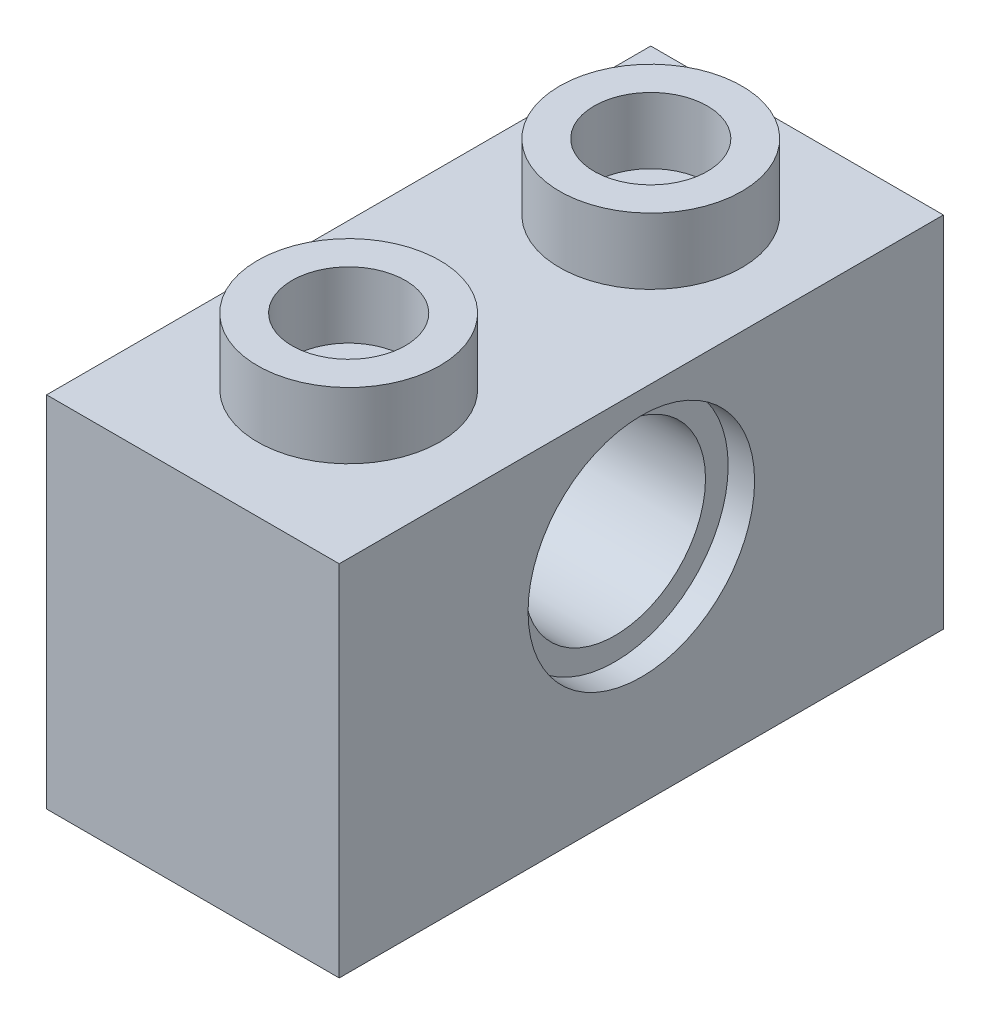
from build123d import *

# Parameters (mm, degrees)
SKETCH1_W           = 7.75
SKETCH1_H           = 9.5
BOSS_EXTRUDE1_DEPTH = 16
SKETCH2_R           = 2.415
SKETCH2_R_2         = 1.5
BOSS_EXTRUDE2_DEPTH = 1.75
SKETCH3_W           = 4.85
SKETCH3_H           = 13.1
CUT_EXTRUDE1_DEPTH  = 1.75
SKETCH4_R           = 1.5
BOSS_EXTRUDE3_DEPTH = 1.75
SKETCH5_R           = 3
CUT_EXTRUDE2_DEPTH  = 0.7
CUT_EXTRUDE3_START  = -0.7
SKETCH6_R           = 3
CUT_EXTRUDE3_DEPTH  = 0.7
SKETCH7_R           = 2.4
CUT_EXTRUDE5_DEPTH  = 19.653484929


with BuildPart() as part:
    # Sketch1 → Boss-Extrude1 (new body)
    with BuildSketch(Plane.XY):
        Rectangle(SKETCH1_W, SKETCH1_H)
    extrude(amount=BOSS_EXTRUDE1_DEPTH)

    # Sketch2 → Boss-Extrude2 (add)
    # profile 1 of 2: a face of its own
    with BuildSketch(Plane(origin=(0, 4.75, 0), x_dir=(1, 0, 0), z_dir=(0, 1, 0))):
        with Locations((0, -3.875)):
            Circle(SKETCH2_R)
        with Locations(Location((0, -3.875, 0), (0, 0, 180))):
            Circle(SKETCH2_R_2, mode=Mode.SUBTRACT)
    # profile 2 of 2: a face of its own
    with BuildSketch(Plane(origin=(0, 4.75, 0), x_dir=(1, 0, 0), z_dir=(0, 1, 0))):
        with Locations((0, -11.875)):
            Circle(SKETCH2_R)
        with Locations(Location((0, -11.875, 0), (0, 0, 180))):
            Circle(SKETCH2_R_2, mode=Mode.SUBTRACT)
    extrude(amount=BOSS_EXTRUDE2_DEPTH)

    # Sketch3 → Cut-Extrude1 (cut)
    with BuildSketch(Plane.XZ.offset(4.75)):
        with Locations((0, 8)):
            Rectangle(SKETCH3_W, SKETCH3_H)
    extrude(amount=-CUT_EXTRUDE1_DEPTH, mode=Mode.SUBTRACT)

    # Sketch4 → Boss-Extrude3 (add)
    with BuildSketch(Plane.XZ.offset(3)):
        with Locations(Location((0, 8, 0), (0, 0, 270))):
            Circle(SKETCH4_R)
    extrude(amount=BOSS_EXTRUDE3_DEPTH)

    # Sketch5 → Cut-Extrude2 (cut)
    with BuildSketch(Plane(origin=(3.875, 0, 0), x_dir=(0, 0, -1), z_dir=(1, 0, 0))):
        with Locations((-8, 1.15)):
            Circle(SKETCH5_R)
    extrude(amount=-CUT_EXTRUDE2_DEPTH, mode=Mode.SUBTRACT)

    # Sketch6 → Cut-Extrude3 (cut)
    with BuildSketch(Plane.ZY.offset(3.875).offset(CUT_EXTRUDE3_START)):
        with Locations(Location((8, 1.15, 0), (0, 0, 180))):
            Circle(SKETCH6_R)
    extrude(amount=CUT_EXTRUDE3_DEPTH, mode=Mode.SUBTRACT)

    # Sketch7 → Cut-Extrude5 (cut, through all)
    with BuildSketch(Plane.ZY.offset(3.175)):
        with Locations((8, 1.15)):
            Circle(SKETCH7_R)
    extrude(amount=-CUT_EXTRUDE5_DEPTH, mode=Mode.SUBTRACT)


solid = part.part
